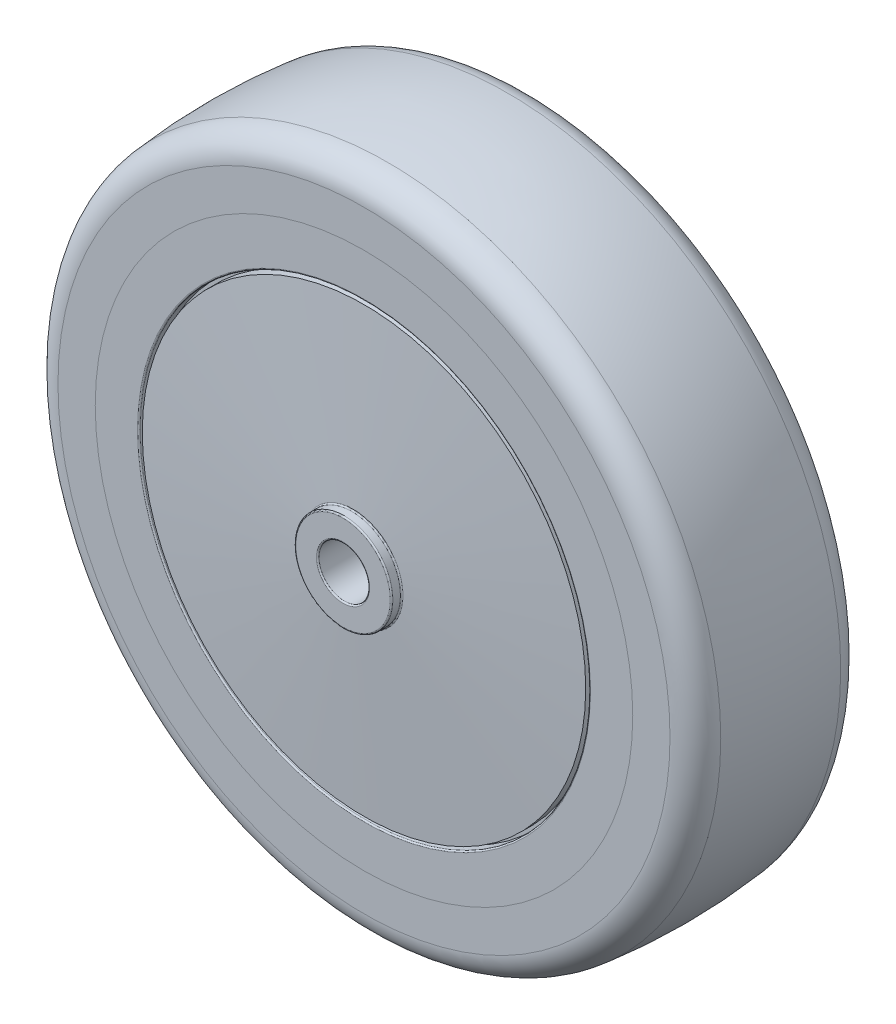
from build123d import *

# Parameters (mm, degrees)
CUT_EXTRUDE1_DEPTH      = 92.968877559
CUT_EXTRUDE1_DEPTH_BACK = 92.968877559
SKETCH26_R              = 4.7625
FILLET15_R              = 5.08
SKETCH89_R              = 50.8
SKETCH89_R_2            = 42.545
BOSS_EXTRUDE4_DEPTH     = 31.75
FILLET16_R              = 0.254
FILLET17_R              = 0.254


with BuildPart() as part:
    # Sketch1 → Revolve1 (revolve)
    with BuildSketch(Plane(origin=(0, 0, 0), x_dir=(0, 0, -1), z_dir=(1, 0, 0)), mode=Mode.PRIVATE) as revolve1_sk:
        with BuildLine():
            Line((-13.97, -50.8), (-15.875, -50.8))
            Line((-15.875, -50.8), (-15.875, -62.308700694))
            ThreePointArc((-15.875, -62.308700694), (0, -63.5), (15.875, -62.308700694))
            Line((15.875, -62.308700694), (15.875, -50.8))
            Line((15.875, -50.8), (13.97, -50.8))
            Line((13.97, -50.8), (13.97, 0))
            Line((13.97, 0), (6.35, 0))
            Line((6.35, 0), (-6.35, 0))
            Line((-6.35, 0), (-13.97, 0))
            Line((-13.97, 0), (-13.97, -50.8))
        make_face()
    revolve(revolve1_sk.sketch.rotate(Axis((0, 0, 86.96894761), (0, 0, -1)), 270), axis=Axis((0, 0, 86.96894761), (0, 0, -1)))

    # Sketch88 → Revolve2 (revolve)
    with BuildSketch(Plane(origin=(0, 0, 0), x_dir=(0, 0, -1), z_dir=(1, 0, 0)), mode=Mode.PRIVATE) as revolve2_sk:
        Polygon((-19.84375, 0), (19.84375, 0), (19.84375, 9.1821), (17.93875, 9.1821), (15.875, 41.91), (-15.875, 41.91), (-17.93875, 9.1821), (-19.84375, 9.1821), align=None)
    revolve(revolve2_sk.sketch.rotate(Axis((0, 0, 0), (0, 0, -1)), 90), axis=Axis((0, 0, 0), (0, 0, -1)))

    # Sketch26 → Cut-Extrude1 (cut, two sides: drawn at the far end of the back side and taken through both)
    with BuildSketch(Plane.XY.offset(-CUT_EXTRUDE1_DEPTH_BACK)):
        Circle(SKETCH26_R)
    extrude(amount=CUT_EXTRUDE1_DEPTH + CUT_EXTRUDE1_DEPTH_BACK, mode=Mode.SUBTRACT)

    # Fillet15
    fillet15_edges = [part.edges().sort_by_distance(p)[0] for p in [
        (-62.308700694, 0, -15.875),
        (-62.308700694, 0, 15.875),
    ]]
    fillet(fillet15_edges, radius=FILLET15_R)

    # Fillet17
    fillet17_edges = [part.edges().sort_by_distance(p)[0] for p in [
        (-9.1821, 0, -17.93875),
        (-9.1821, 0, -19.84375),
        (-9.1821, 0, 19.84375),
        (-9.1821, 0, 17.93875),
        (-4.7625, 0, -19.84375),
        (-4.7625, 0, 19.84375),
    ]]
    fillet(fillet17_edges, radius=FILLET17_R)


with BuildPart() as body_2:
    # Sketch89 → Boss-Extrude4 (new body)
    with BuildSketch(Plane.XY.offset(15.875)):
        Circle(SKETCH89_R)
        Circle(SKETCH89_R_2, mode=Mode.SUBTRACT)
    extrude(amount=-BOSS_EXTRUDE4_DEPTH)

    # Fillet16
    fillet16_edges = [body_2.edges().sort_by_distance(p)[0] for p in [
        (-42.545, 0, 15.875),
        (-42.545, 0, -15.875),
    ]]
    fillet(fillet16_edges, radius=FILLET16_R)


solid = Compound([part.part, body_2.part])
